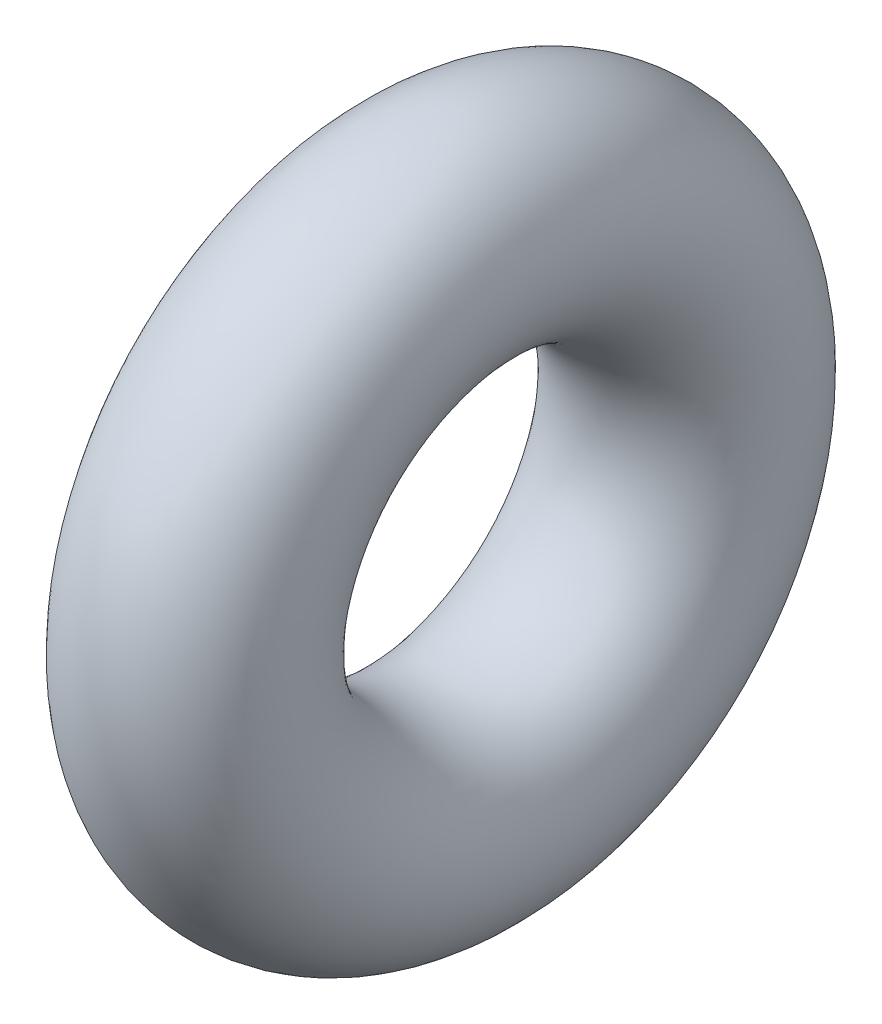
from build123d import *

# Parameters (mm, degrees)
SKETCH1_R = 1.7653


with BuildPart() as part:
    # Sketch1 → Revolve1 (revolve)
    with BuildSketch(Plane.XY, mode=Mode.PRIVATE) as revolve1_sk:
        with Locations((0, 4.1275)):
            Circle(SKETCH1_R)
    revolve(revolve1_sk.sketch.rotate(Axis((0, 0, 0), (-1, 0, 0)), 90), axis=Axis((0, 0, 0), (-1, 0, 0)))


solid = part.part
